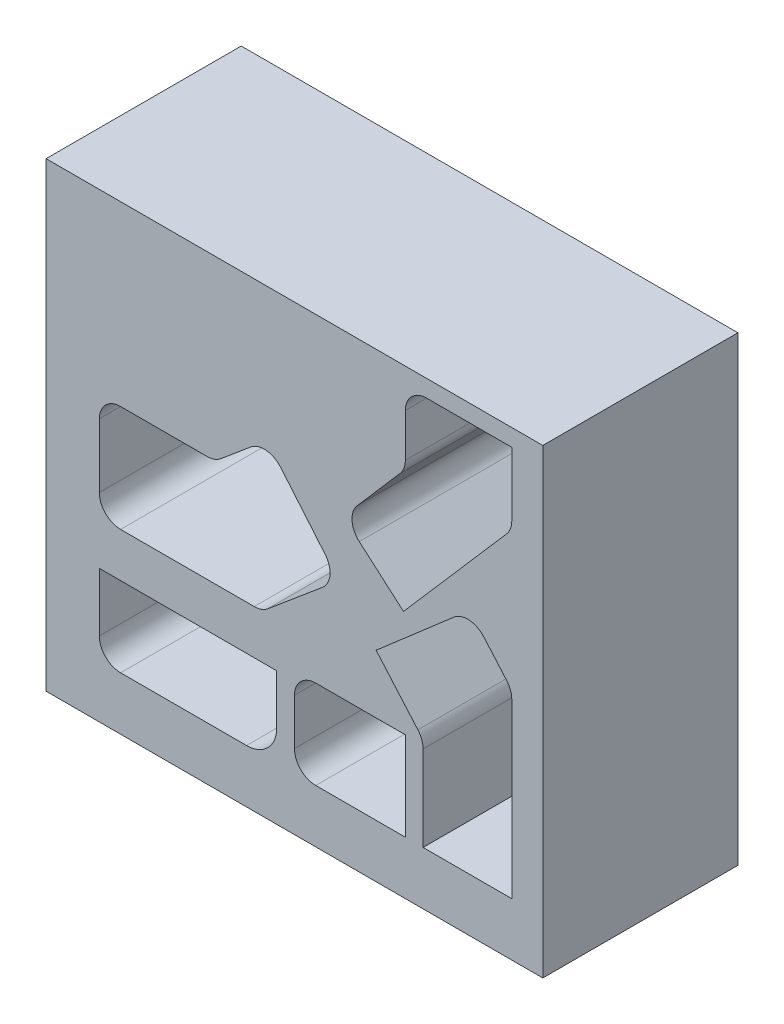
from build123d import *

# Parameters (mm, degrees)
SKETCH1_W           = 177.8
SKETCH1_H           = 165.1
BOSS_EXTRUDE1_DEPTH = 69.85


with BuildPart() as part:
    # Sketch1 → Boss-Extrude1 (new body)
    with BuildSketch(Plane.XY):
        with Locations((69.85, 63.5)):
            Rectangle(SKETCH1_W, SKETCH1_H)
        with BuildLine():
            Line((7.62, 0), (52.705, 0))
            ThreePointArc((52.705, 0), (60.338217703, 3.161782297), (63.5, 10.795))
            Line((63.5, 10.795), (63.5, 28.575))
            Line((63.5, 28.575), (0, 28.575))
            Line((0, 28.575), (0, 7.62))
            ThreePointArc((0, 7.62), (2.231846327, 2.231846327), (7.62, 0))
        make_face(mode=Mode.SUBTRACT)
        with BuildLine():
            Line((54.173023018, 93.269283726), (43.522866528, 84.332741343))
            ThreePointArc((43.522866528, 84.332741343), (41.231018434, 83.00954223), (38.624824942, 82.55))
            Line((38.624824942, 82.55), (7.62, 82.55))
            ThreePointArc((7.62, 82.55), (2.231846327, 80.318153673), (0, 74.93))
            Line((0, 74.93), (0, 52.07))
            ThreePointArc((0, 52.07), (2.231846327, 46.681846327), (7.62, 44.45))
            Line((7.62, 44.45), (55.455744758, 44.45))
            ThreePointArc((55.455744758, 44.45), (58.06193825, 44.90954223), (60.353786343, 46.232741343))
            Line((60.353786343, 46.232741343), (79.887741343, 62.623675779))
            ThreePointArc((79.887741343, 62.623675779), (82.580703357, 67.796807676), (80.826958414, 73.358976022))
            Line((80.826958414, 73.358976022), (64.90832326, 92.330066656))
            ThreePointArc((64.90832326, 92.330066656), (59.735191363, 95.023028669), (54.173023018, 93.269283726))
        make_face(mode=Mode.SUBTRACT)
        with BuildLine():
            Line((109.554075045, 31.75), (77.47, 31.75))
            ThreePointArc((77.47, 31.75), (72.081846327, 29.518153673), (69.85, 24.13))
            Line((69.85, 24.13), (69.85, 7.62))
            ThreePointArc((69.85, 7.62), (72.081846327, 2.231846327), (77.47, 0))
            Line((77.47, 0), (109.554075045, 0))
            Line((109.554075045, 0), (109.554075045, 31.75))
        make_face(mode=Mode.SUBTRACT)
        with BuildLine():
            Line((115.904075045, 0), (147.654075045, 0))
            Line((147.654075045, 0), (147.654075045, 61.763395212))
            ThreePointArc((147.654075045, 61.763395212), (147.172168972, 64.430231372), (145.787404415, 66.759754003))
            Line((145.787404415, 66.759754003), (137.651725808, 76.128024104))
            ThreePointArc((137.651725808, 76.128024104), (132.433655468, 78.732842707), (126.902037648, 76.884994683))
            Line((126.902037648, 76.884994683), (99.094279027, 52.735927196))
            Line((99.094279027, 52.735927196), (114.037404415, 35.528851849))
            ThreePointArc((114.037404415, 35.528851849), (115.422168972, 33.199329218), (115.904075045, 30.532493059))
            Line((115.904075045, 30.532493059), (115.904075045, 0))
        make_face(mode=Mode.SUBTRACT)
        with BuildLine():
            Line((93.072315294, 83.396512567), (108.893971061, 69.656525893))
            Line((108.893971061, 69.656525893), (145.787404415, 112.139478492))
            ThreePointArc((145.787404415, 112.139478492), (147.172168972, 114.469001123), (147.654075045, 117.135837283))
            Line((147.654075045, 117.135837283), (147.654075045, 139.925756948))
            Line((147.654075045, 139.925756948), (117.174075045, 139.925756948))
            ThreePointArc((117.174075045, 139.925756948), (111.785921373, 137.693910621), (109.554075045, 132.305756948))
            Line((109.554075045, 132.305756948), (109.554075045, 116.843554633))
            ThreePointArc((109.554075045, 116.843554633), (109.072168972, 114.176718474), (107.687404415, 111.847195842))
            Line((107.687404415, 111.847195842), (92.315344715, 94.146200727))
            ThreePointArc((92.315344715, 94.146200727), (90.467496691, 88.614582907), (93.072315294, 83.396512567))
        make_face(mode=Mode.SUBTRACT)
    extrude(amount=-BOSS_EXTRUDE1_DEPTH)


solid = part.part
